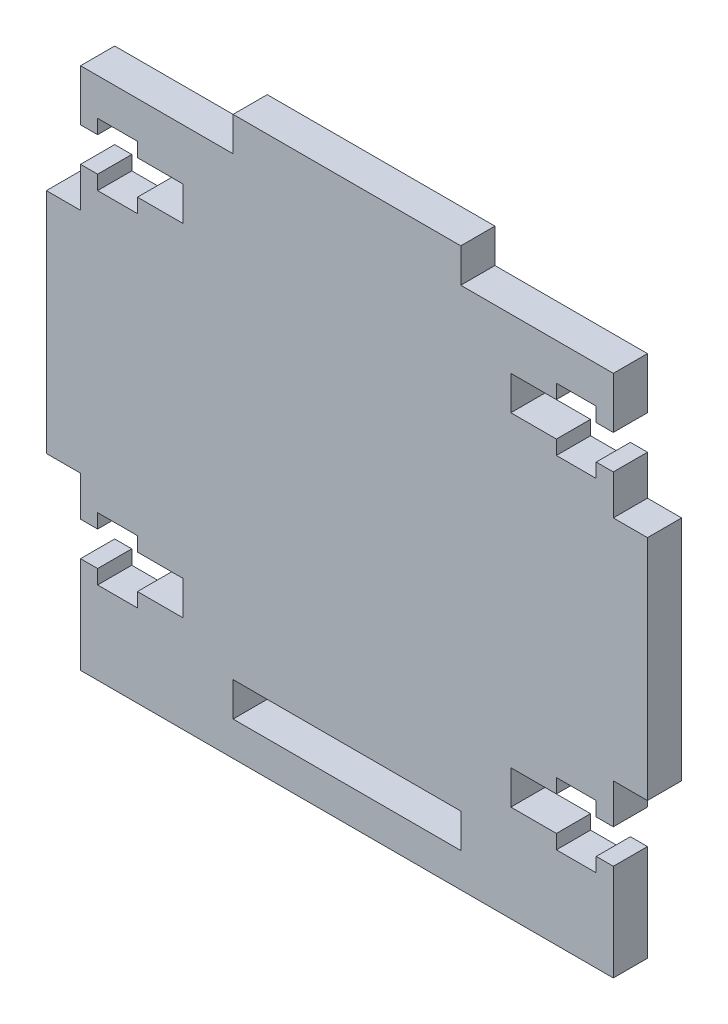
from build123d import *

# Parameters (mm, degrees)
BOSS_EXTRUDE1_DEPTH = 3
SKETCH2_W           = 20
SKETCH2_H           = 3
CUT_EXTRUDE1_DEPTH  = 10


with BuildPart() as part:
    # Sketch1 → Boss-Extrude1 (new body)
    with BuildSketch(Plane.XY):
        Polygon((23.4, -9.5), (26.4, -9.5), (26.4, 10.5), (23.4, 10.5), (23.4, 14), (21.9, 14), (21.9, 12.75), (18.4, 12.75), (18.4, 14), (14.4, 14), (14.4, 17), (18.4, 17), (18.4, 18.25), (21.9, 18.25), (21.9, 17), (23.4, 17), (23.4, 21.5), (10, 21.5), (10, 24.5), (-10, 24.5), (-10, 21.5), (-23.4, 21.5), (-23.4, 17), (-21.9, 17), (-21.9, 18.25), (-18.4, 18.25), (-18.4, 17), (-14.4, 17), (-14.4, 14), (-18.4, 14), (-18.4, 12.75), (-21.9, 12.75), (-21.9, 14), (-23.4, 14), (-23.4, 10.5), (-26.4, 10.5), (-26.4, -9.5), (-23.4, -9.5), (-23.4, -13), (-21.9, -13), (-21.9, -11.75), (-18.4, -11.75), (-18.4, -13), (-14.4, -13), (-14.4, -16), (-18.4, -16), (-18.4, -17.25), (-21.9, -17.25), (-21.9, -16), (-23.4, -16), (-23.4, -24.5), (23.4, -24.5), (23.4, -16), (21.9, -16), (21.9, -17.25), (18.4, -17.25), (18.4, -16), (14.4, -16), (14.4, -13), (18.4, -13), (18.4, -11.75), (21.9, -11.75), (21.9, -13), (23.4, -13), align=None)
    extrude(amount=BOSS_EXTRUDE1_DEPTH)

    # Sketch2 → Cut-Extrude1 (cut)
    with BuildSketch(Plane.XY.offset(3)):
        with Locations((0, -20)):
            Rectangle(SKETCH2_W, SKETCH2_H)
    extrude(amount=-CUT_EXTRUDE1_DEPTH, mode=Mode.SUBTRACT)


solid = part.part
